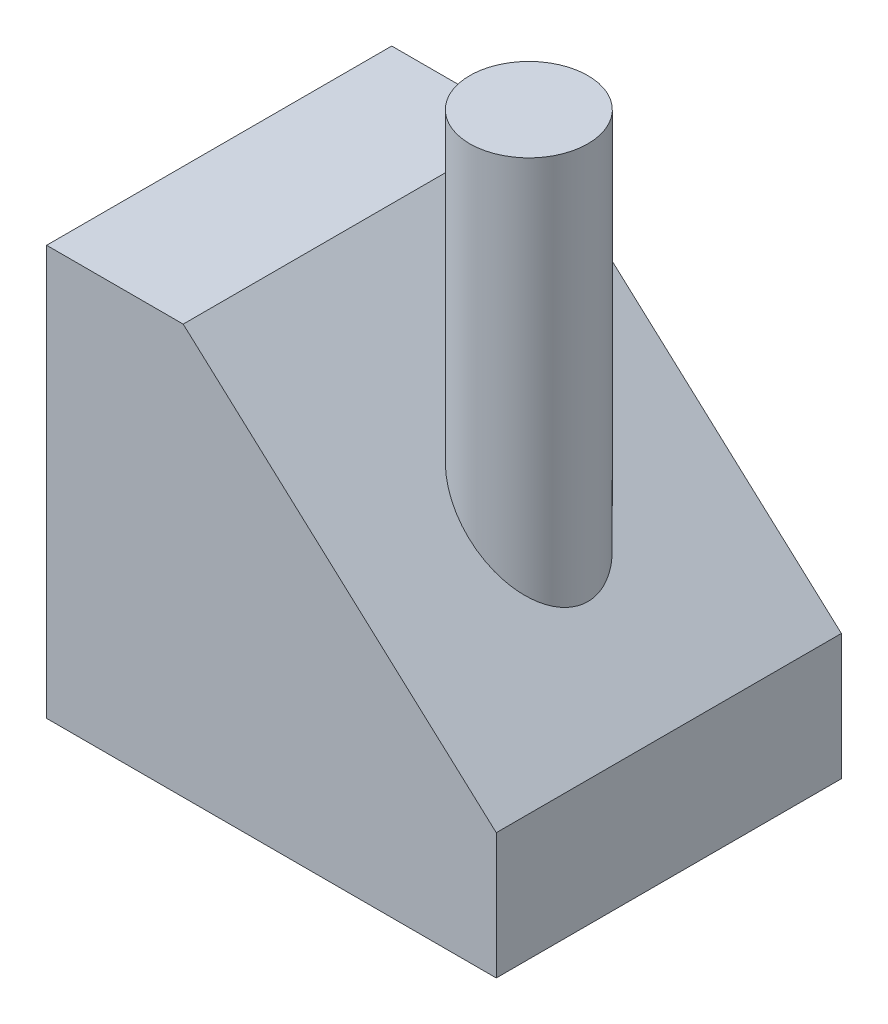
from build123d import *

# Parameters (mm, degrees)
EXTRUDE1_DEPTH = 42
SKETCH3_R      = 14.381046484
EXTRUDE2_DEPTH = 145


with BuildPart() as part:
    # Sketch2 → Extrude1 (new, symmetric)
    with BuildSketch(Plane.XY):
        Polygon((0, 0), (109.444117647, 0), (109.444117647, 30.629411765), (33.244117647, 99.732352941), (0, 99.732352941), align=None)
    extrude(amount=EXTRUDE1_DEPTH, both=True)

    # Sketch3 → Extrude2 (add)
    with BuildSketch(Plane(origin=(0, 0, 0), x_dir=(1, 0, 0), z_dir=(0, 1, 0))):
        with Locations((75.368824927, 0)):
            Circle(SKETCH3_R)
    extrude(amount=EXTRUDE2_DEPTH)


solid = part.part
